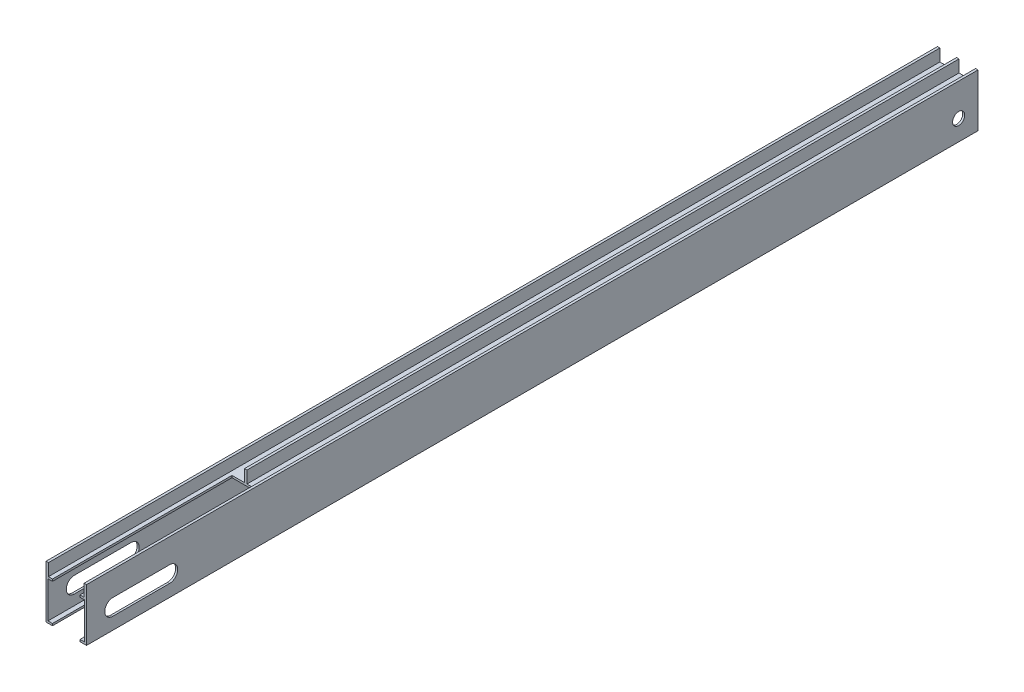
from build123d import *

# Parameters (mm, degrees)
ESQUISSE1_W             = 100
ESQUISSE1_H             = 100
ESQUISSE1_W_2           = 90
ESQUISSE1_H_2           = 90
BOSS_EXTRU_1_DEPTH      = 2200
ESQUISSE2_W             = 6
ESQUISSE2_H             = 30
BOSS_EXTRU_2_DEPTH      = 2200
ESQUISSE3_W             = 90
ESQUISSE3_H             = 55.38876498
ENL_V_MAT_EXTRU_1_DEPTH = 103
ESQUISSE4_R             = 15
ENL_V_MAT_EXTRU_2_DEPTH = 122
ENL_V_MAT_EXTRU_3_DEPTH = 357
ESQUISSE7_W             = 68
ESQUISSE7_H             = 117.188546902
ENL_V_MAT_EXTRU_5_DEPTH = 443
ESQUISSE8_W             = 6
ESQUISSE8_H             = 30
BOSS_EXTRU_3_DEPTH      = 1757


with BuildPart() as part:
    # Esquisse1 → Boss.-Extru.1 (new body)
    with BuildSketch(Plane.XY):
        Rectangle(ESQUISSE1_W, ESQUISSE1_H)
        Rectangle(ESQUISSE1_W_2, ESQUISSE1_H_2, mode=Mode.SUBTRACT)
    extrude(amount=BOSS_EXTRU_1_DEPTH)

    # Esquisse2 → Boss.-Extru.2 (add)
    with BuildSketch(Plane(origin=(0, 0, 0), x_dir=(-1, 0, 0), z_dir=(0, 0, -1))):
        with Locations((-47, 65)):
            Rectangle(ESQUISSE2_W, ESQUISSE2_H)
        with Locations((47, 65)):
            Rectangle(ESQUISSE2_W, ESQUISSE2_H)
    extrude(amount=-BOSS_EXTRU_2_DEPTH)

    # Esquisse3 → Enl_v. mat.-Extru.1 (cut)
    with BuildSketch(Plane(origin=(0, 0, 0), x_dir=(-1, 0, 0), z_dir=(0, 0, -1))):
        with Locations((0, -45)):
            Rectangle(ESQUISSE3_W, ESQUISSE3_H)
    extrude(amount=-ENL_V_MAT_EXTRU_1_DEPTH, mode=Mode.SUBTRACT)

    # Esquisse4 → Enl_v. mat.-Extru.2 (cut)
    with BuildSketch(Plane(origin=(50, 0, 0), x_dir=(0, 0, -1), z_dir=(1, 0, 0))):
        with Locations((-47.696960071, 0)):
            Circle(ESQUISSE4_R)
    extrude(amount=-ENL_V_MAT_EXTRU_2_DEPTH, mode=Mode.SUBTRACT)

    # Esquisse5 → Enl_v. mat.-Extru.3 (cut)
    with BuildSketch(Plane(origin=(50, 0, 0), x_dir=(0, 0, -1), z_dir=(1, 0, 0))):
        with BuildLine():
            Line((-2135, 20), (-1995, 20))
            ThreePointArc((-1995, 20), (-1975, 0), (-1995, -20))
            Line((-1995, -20), (-2135, -20))
            ThreePointArc((-2135, -20), (-2155, 0), (-2135, 20))
        make_face()
    extrude(amount=-ENL_V_MAT_EXTRU_3_DEPTH, mode=Mode.SUBTRACT)

    # Esquisse7 → Enl_v. mat.-Extru.5 (cut)
    with BuildSketch(Plane.XY.offset(2200)):
        with Locations((0, 0.725918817)):
            Rectangle(ESQUISSE7_W, ESQUISSE7_H)
    extrude(amount=-ENL_V_MAT_EXTRU_5_DEPTH, mode=Mode.SUBTRACT)

    # Esquisse8 → Boss.-Extru.3 (add)
    with BuildSketch(Plane.XY.offset(1757)):
        with Locations((0, 65)):
            Rectangle(ESQUISSE8_W, ESQUISSE8_H)
    extrude(amount=-BOSS_EXTRU_3_DEPTH)


solid = part.part
